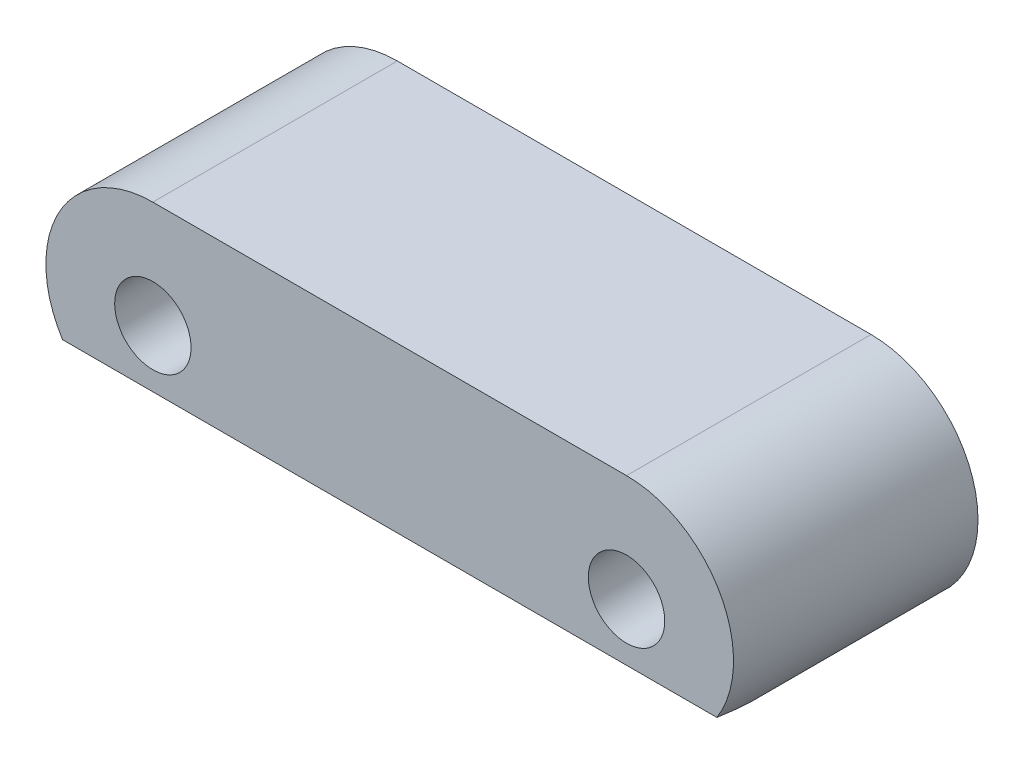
ISO-10303-21;
HEADER;
FILE_DESCRIPTION(('STEP AP214'),'2;1');
FILE_NAME('part.step','',(''),(''),'','','');
FILE_SCHEMA(('AUTOMOTIVE_DESIGN { 1 0 10303 214 1 1 1 1 }'));
ENDSEC;
DATA;
#1=APPLICATION_CONTEXT('core data for automotive mechanical design processes');
#2=APPLICATION_PROTOCOL_DEFINITION('international standard','automotive_design',2000,#1);
#3=PRODUCT_CONTEXT('',#1,'mechanical');
#4=PRODUCT('Part','Part','',(#3));
#5=PRODUCT_RELATED_PRODUCT_CATEGORY('part','',(#4));
#6=PRODUCT_DEFINITION_FORMATION('','',#4);
#7=PRODUCT_DEFINITION_CONTEXT('part definition',#1,'design');
#8=PRODUCT_DEFINITION('design','',#6,#7);
#9=PRODUCT_DEFINITION_SHAPE('','',#8);
#10=(LENGTH_UNIT() NAMED_UNIT(*) SI_UNIT(.MILLI.,.METRE.));
#11=(NAMED_UNIT(*) PLANE_ANGLE_UNIT() SI_UNIT($,.RADIAN.));
#12=(NAMED_UNIT(*) SI_UNIT($,.STERADIAN.) SOLID_ANGLE_UNIT());
#13=UNCERTAINTY_MEASURE_WITH_UNIT(LENGTH_MEASURE(1.E-05),#10,'distance_accuracy_value','');
#14=(GEOMETRIC_REPRESENTATION_CONTEXT(3) GLOBAL_UNCERTAINTY_ASSIGNED_CONTEXT((#13)) GLOBAL_UNIT_ASSIGNED_CONTEXT((#10,
#11,#12)) REPRESENTATION_CONTEXT('',''));
#15=CARTESIAN_POINT('',(0.,0.,0.));
#16=DIRECTION('',(0.,0.,1.));
#17=DIRECTION('',(1.,0.,0.));
#18=AXIS2_PLACEMENT_3D('',#15,#16,#17);
#19=CARTESIAN_POINT('',(0.,0.,16.));
#20=DIRECTION('',(0.,0.,1.));
#21=DIRECTION('',(1.,0.,0.));
#22=AXIS2_PLACEMENT_3D('',#19,#20,#21);
#23=PLANE('',#22);
#24=CARTESIAN_POINT('',(0.,0.,16.));
#25=DIRECTION('',(0.,0.,-1.));
#26=DIRECTION('',(-1.,0.,0.));
#27=AXIS2_PLACEMENT_3D('',#24,#25,#26);
#28=CIRCLE('',#27,2.5);
#29=CARTESIAN_POINT('',(-2.49999999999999,0.,16.));
#30=VERTEX_POINT('',#29);
#31=EDGE_CURVE('E156',#30,#30,#28,.T.);
#32=ORIENTED_EDGE('',*,*,#31,.T.);
#33=EDGE_LOOP('',(#32));
#34=FACE_BOUND('',#33,.T.);
#35=DIRECTION('',(-1.,0.,0.));
#36=VECTOR('',#35,1.);
#37=CARTESIAN_POINT('',(0.,-3.750803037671,16.));
#38=LINE('',#37,#36);
#39=CARTESIAN_POINT('',(36.9102856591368,-3.750803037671,16.));
#40=VERTEX_POINT('',#39);
#41=CARTESIAN_POINT('',(-5.91028565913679,-3.750803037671,16.));
#42=VERTEX_POINT('',#41);
#43=EDGE_CURVE('E11',#40,#42,#38,.T.);
#44=ORIENTED_EDGE('',*,*,#43,.F.);
#45=CARTESIAN_POINT('',(31.,0.,16.));
#46=DIRECTION('',(0.,0.,1.));
#47=DIRECTION('',(1.,0.,0.));
#48=AXIS2_PLACEMENT_3D('',#45,#46,#47);
#49=CIRCLE('',#48,7.);
#50=CARTESIAN_POINT('',(31.,6.99999999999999,16.));
#51=VERTEX_POINT('',#50);
#52=EDGE_CURVE('E86',#40,#51,#49,.T.);
#53=ORIENTED_EDGE('',*,*,#52,.T.);
#54=DIRECTION('',(-1.,0.,0.));
#55=VECTOR('',#54,1.);
#56=CARTESIAN_POINT('',(0.,6.99999999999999,16.));
#57=LINE('',#56,#55);
#58=CARTESIAN_POINT('',(0.,6.99999999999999,16.));
#59=VERTEX_POINT('',#58);
#60=EDGE_CURVE('E50',#51,#59,#57,.T.);
#61=ORIENTED_EDGE('',*,*,#60,.T.);
#62=CARTESIAN_POINT('',(0.,0.,16.));
#63=DIRECTION('',(0.,0.,1.));
#64=DIRECTION('',(1.,0.,0.));
#65=AXIS2_PLACEMENT_3D('',#62,#63,#64);
#66=CIRCLE('',#65,7.);
#67=EDGE_CURVE('E81',#59,#42,#66,.T.);
#68=ORIENTED_EDGE('',*,*,#67,.T.);
#69=EDGE_LOOP('',(#44,#53,#61,#68));
#70=FACE_BOUND('',#69,.T.);
#71=CARTESIAN_POINT('',(31.,0.,16.));
#72=DIRECTION('',(0.,0.,-1.));
#73=DIRECTION('',(-1.,0.,0.));
#74=AXIS2_PLACEMENT_3D('',#71,#72,#73);
#75=CIRCLE('',#74,2.5);
#76=CARTESIAN_POINT('',(28.5,0.,16.));
#77=VERTEX_POINT('',#76);
#78=EDGE_CURVE('E152',#77,#77,#75,.T.);
#79=ORIENTED_EDGE('',*,*,#78,.T.);
#80=EDGE_LOOP('',(#79));
#81=FACE_BOUND('',#80,.T.);
#82=ADVANCED_FACE('F28',(#34,#70,#81),#23,.T.);
#83=CARTESIAN_POINT('',(0.,0.,16.));
#84=DIRECTION('',(0.,0.,-1.));
#85=DIRECTION('',(-1.,0.,0.));
#86=AXIS2_PLACEMENT_3D('',#83,#84,#85);
#87=CYLINDRICAL_SURFACE('',#86,7.);
#88=DIRECTION('',(0.,0.,-1.));
#89=VECTOR('',#88,1.);
#90=CARTESIAN_POINT('',(0.,-7.00000000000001,16.));
#91=LINE('',#90,#89);
#92=CARTESIAN_POINT('',(0.,-7.,6.));
#93=VERTEX_POINT('',#92);
#94=CARTESIAN_POINT('',(0.,-7.,0.));
#95=VERTEX_POINT('',#94);
#96=EDGE_CURVE('E36',#93,#95,#91,.T.);
#97=ORIENTED_EDGE('',*,*,#96,.F.);
#98=CARTESIAN_POINT('',(0.,0.,27.5437847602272));
#99=DIRECTION('',(0.,0.951056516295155,-0.309016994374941));
#100=DIRECTION('',(0.,-0.309016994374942,-0.951056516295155));
#101=AXIS2_PLACEMENT_3D('',#98,#99,#100);
#102=ELLIPSE('',#101,22.652475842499,7.);
#103=EDGE_CURVE('E74',#93,#42,#102,.T.);
#104=ORIENTED_EDGE('',*,*,#103,.T.);
#105=ORIENTED_EDGE('',*,*,#67,.F.);
#106=DIRECTION('',(0.,0.,-1.));
#107=VECTOR('',#106,1.);
#108=CARTESIAN_POINT('',(0.,6.99999999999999,16.));
#109=LINE('',#108,#107);
#110=CARTESIAN_POINT('',(0.,7.00000000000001,0.));
#111=VERTEX_POINT('',#110);
#112=EDGE_CURVE('E95',#59,#111,#109,.T.);
#113=ORIENTED_EDGE('',*,*,#112,.T.);
#114=CARTESIAN_POINT('',(0.,0.,0.));
#115=DIRECTION('',(0.,0.,1.));
#116=DIRECTION('',(1.,0.,0.));
#117=AXIS2_PLACEMENT_3D('',#114,#115,#116);
#118=CIRCLE('',#117,7.);
#119=EDGE_CURVE('E83',#111,#95,#118,.T.);
#120=ORIENTED_EDGE('',*,*,#119,.T.);
#121=EDGE_LOOP('',(#97,#104,#105,#113,#120));
#122=FACE_BOUND('',#121,.T.);
#123=ADVANCED_FACE('F30',(#122),#87,.T.);
#124=CARTESIAN_POINT('',(0.,-7.00000000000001,16.));
#125=DIRECTION('',(0.,1.,0.));
#126=DIRECTION('',(0.,0.,1.));
#127=AXIS2_PLACEMENT_3D('',#124,#125,#126);
#128=PLANE('',#127);
#129=DIRECTION('',(0.,0.,-1.));
#130=VECTOR('',#129,1.);
#131=CARTESIAN_POINT('',(31.,-7.00000000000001,16.));
#132=LINE('',#131,#130);
#133=CARTESIAN_POINT('',(31.,-7.00000000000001,6.));
#134=VERTEX_POINT('',#133);
#135=CARTESIAN_POINT('',(31.,-7.,0.));
#136=VERTEX_POINT('',#135);
#137=EDGE_CURVE('E100',#134,#136,#132,.T.);
#138=ORIENTED_EDGE('',*,*,#137,.F.);
#139=DIRECTION('',(1.,0.,0.));
#140=VECTOR('',#139,1.);
#141=CARTESIAN_POINT('',(-7.,-7.,6.));
#142=LINE('',#141,#140);
#143=EDGE_CURVE('E108',#93,#134,#142,.T.);
#144=ORIENTED_EDGE('',*,*,#143,.F.);
#145=ORIENTED_EDGE('',*,*,#96,.T.);
#146=DIRECTION('',(1.,0.,0.));
#147=VECTOR('',#146,1.);
#148=CARTESIAN_POINT('',(0.,-7.,0.));
#149=LINE('',#148,#147);
#150=EDGE_CURVE('E106',#95,#136,#149,.T.);
#151=ORIENTED_EDGE('',*,*,#150,.T.);
#152=EDGE_LOOP('',(#138,#144,#145,#151));
#153=FACE_BOUND('',#152,.T.);
#154=ADVANCED_FACE('F105',(#153),#128,.F.);
#155=CARTESIAN_POINT('',(31.,0.,16.));
#156=DIRECTION('',(0.,0.,-1.));
#157=DIRECTION('',(-1.,0.,0.));
#158=AXIS2_PLACEMENT_3D('',#155,#156,#157);
#159=CYLINDRICAL_SURFACE('',#158,7.);
#160=ORIENTED_EDGE('',*,*,#52,.F.);
#161=CARTESIAN_POINT('',(31.,0.,27.5437847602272));
#162=DIRECTION('',(0.,0.951056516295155,-0.309016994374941));
#163=DIRECTION('',(0.,-0.309016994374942,-0.951056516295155));
#164=AXIS2_PLACEMENT_3D('',#161,#162,#163);
#165=ELLIPSE('',#164,22.652475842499,7.);
#166=EDGE_CURVE('E42',#40,#134,#165,.T.);
#167=ORIENTED_EDGE('',*,*,#166,.T.);
#168=ORIENTED_EDGE('',*,*,#137,.T.);
#169=CARTESIAN_POINT('',(31.,0.,0.));
#170=DIRECTION('',(0.,0.,1.));
#171=DIRECTION('',(1.,0.,0.));
#172=AXIS2_PLACEMENT_3D('',#169,#170,#171);
#173=CIRCLE('',#172,7.);
#174=CARTESIAN_POINT('',(31.,7.00000000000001,0.));
#175=VERTEX_POINT('',#174);
#176=EDGE_CURVE('E90',#136,#175,#173,.T.);
#177=ORIENTED_EDGE('',*,*,#176,.T.);
#178=DIRECTION('',(0.,0.,-1.));
#179=VECTOR('',#178,1.);
#180=CARTESIAN_POINT('',(31.,6.99999999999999,16.));
#181=LINE('',#180,#179);
#182=EDGE_CURVE('E97',#51,#175,#181,.T.);
#183=ORIENTED_EDGE('',*,*,#182,.F.);
#184=EDGE_LOOP('',(#160,#167,#168,#177,#183));
#185=FACE_BOUND('',#184,.T.);
#186=ADVANCED_FACE('F118',(#185),#159,.T.);
#187=CARTESIAN_POINT('',(0.,6.99999999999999,16.));
#188=DIRECTION('',(0.,-1.,0.));
#189=DIRECTION('',(0.,0.,-1.));
#190=AXIS2_PLACEMENT_3D('',#187,#188,#189);
#191=PLANE('',#190);
#192=DIRECTION('',(-1.,0.,0.));
#193=VECTOR('',#192,1.);
#194=CARTESIAN_POINT('',(0.,7.00000000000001,0.));
#195=LINE('',#194,#193);
#196=EDGE_CURVE('E87',#175,#111,#195,.T.);
#197=ORIENTED_EDGE('',*,*,#196,.T.);
#198=ORIENTED_EDGE('',*,*,#112,.F.);
#199=ORIENTED_EDGE('',*,*,#60,.F.);
#200=ORIENTED_EDGE('',*,*,#182,.T.);
#201=EDGE_LOOP('',(#197,#198,#199,#200));
#202=FACE_BOUND('',#201,.T.);
#203=ADVANCED_FACE('F120',(#202),#191,.F.);
#204=CARTESIAN_POINT('',(0.,0.,0.));
#205=DIRECTION('',(0.,0.,1.));
#206=DIRECTION('',(1.,0.,0.));
#207=AXIS2_PLACEMENT_3D('',#204,#205,#206);
#208=PLANE('',#207);
#209=CARTESIAN_POINT('',(31.,0.,0.));
#210=DIRECTION('',(0.,0.,-1.));
#211=DIRECTION('',(-1.,0.,0.));
#212=AXIS2_PLACEMENT_3D('',#209,#210,#211);
#213=CIRCLE('',#212,2.49999999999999);
#214=CARTESIAN_POINT('',(28.5,0.,0.));
#215=VERTEX_POINT('',#214);
#216=EDGE_CURVE('E155',#215,#215,#213,.T.);
#217=ORIENTED_EDGE('',*,*,#216,.F.);
#218=EDGE_LOOP('',(#217));
#219=FACE_BOUND('',#218,.T.);
#220=CARTESIAN_POINT('',(0.,0.,0.));
#221=DIRECTION('',(0.,0.,-1.));
#222=DIRECTION('',(-1.,0.,0.));
#223=AXIS2_PLACEMENT_3D('',#220,#221,#222);
#224=CIRCLE('',#223,2.49999999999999);
#225=CARTESIAN_POINT('',(-2.49999999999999,0.,0.));
#226=VERTEX_POINT('',#225);
#227=EDGE_CURVE('E158',#226,#226,#224,.T.);
#228=ORIENTED_EDGE('',*,*,#227,.F.);
#229=EDGE_LOOP('',(#228));
#230=FACE_BOUND('',#229,.T.);
#231=ORIENTED_EDGE('',*,*,#119,.F.);
#232=ORIENTED_EDGE('',*,*,#196,.F.);
#233=ORIENTED_EDGE('',*,*,#176,.F.);
#234=ORIENTED_EDGE('',*,*,#150,.F.);
#235=EDGE_LOOP('',(#231,#232,#233,#234));
#236=FACE_BOUND('',#235,.T.);
#237=ADVANCED_FACE('F111',(#219,#230,#236),#208,.F.);
#238=CARTESIAN_POINT('',(-7.,-7.,6.));
#239=DIRECTION('',(0.,0.951056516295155,-0.309016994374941));
#240=DIRECTION('',(0.,0.309016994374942,0.951056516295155));
#241=AXIS2_PLACEMENT_3D('',#238,#239,#240);
#242=PLANE('',#241);
#243=ORIENTED_EDGE('',*,*,#143,.T.);
#244=ORIENTED_EDGE('',*,*,#166,.F.);
#245=ORIENTED_EDGE('',*,*,#43,.T.);
#246=ORIENTED_EDGE('',*,*,#103,.F.);
#247=EDGE_LOOP('',(#243,#244,#245,#246));
#248=FACE_BOUND('',#247,.T.);
#249=ADVANCED_FACE('F73',(#248),#242,.F.);
#250=CARTESIAN_POINT('',(0.,0.,0.));
#251=DIRECTION('',(0.,0.,-1.));
#252=DIRECTION('',(-1.,0.,0.));
#253=AXIS2_PLACEMENT_3D('',#250,#251,#252);
#254=CYLINDRICAL_SURFACE('',#253,2.49999999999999);
#255=CARTESIAN_POINT('',(-2.49999999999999,0.,16.));
#256=CARTESIAN_POINT('',(-2.49999999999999,0.,15.8333333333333));
#257=CARTESIAN_POINT('',(-2.49999999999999,0.,15.6666666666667));
#258=CARTESIAN_POINT('',(-2.49999999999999,0.,15.3333333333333));
#259=CARTESIAN_POINT('',(-2.49999999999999,0.,15.1666666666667));
#260=CARTESIAN_POINT('',(-2.49999999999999,0.,14.8333333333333));
#261=CARTESIAN_POINT('',(-2.49999999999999,0.,14.6666666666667));
#262=CARTESIAN_POINT('',(-2.49999999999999,0.,14.3333333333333));
#263=CARTESIAN_POINT('',(-2.49999999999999,0.,14.1666666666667));
#264=CARTESIAN_POINT('',(-2.49999999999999,0.,13.8333333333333));
#265=CARTESIAN_POINT('',(-2.49999999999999,0.,13.6666666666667));
#266=CARTESIAN_POINT('',(-2.49999999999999,0.,13.3333333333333));
#267=CARTESIAN_POINT('',(-2.49999999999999,0.,13.1666666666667));
#268=CARTESIAN_POINT('',(-2.49999999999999,0.,12.8333333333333));
#269=CARTESIAN_POINT('',(-2.49999999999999,0.,12.6666666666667));
#270=CARTESIAN_POINT('',(-2.49999999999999,0.,12.3333333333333));
#271=CARTESIAN_POINT('',(-2.49999999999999,0.,12.1666666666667));
#272=CARTESIAN_POINT('',(-2.49999999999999,0.,11.8333333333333));
#273=CARTESIAN_POINT('',(-2.49999999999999,0.,11.6666666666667));
#274=CARTESIAN_POINT('',(-2.49999999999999,0.,11.3333333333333));
#275=CARTESIAN_POINT('',(-2.49999999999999,0.,11.1666666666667));
#276=CARTESIAN_POINT('',(-2.49999999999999,0.,10.8333333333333));
#277=CARTESIAN_POINT('',(-2.49999999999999,0.,10.6666666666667));
#278=CARTESIAN_POINT('',(-2.49999999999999,0.,10.3333333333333));
#279=CARTESIAN_POINT('',(-2.49999999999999,0.,10.1666666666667));
#280=CARTESIAN_POINT('',(-2.49999999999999,0.,9.83333333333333));
#281=CARTESIAN_POINT('',(-2.49999999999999,0.,9.66666666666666));
#282=CARTESIAN_POINT('',(-2.49999999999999,0.,9.33333333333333));
#283=CARTESIAN_POINT('',(-2.49999999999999,0.,9.16666666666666));
#284=CARTESIAN_POINT('',(-2.49999999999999,0.,8.83333333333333));
#285=CARTESIAN_POINT('',(-2.49999999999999,0.,8.66666666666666));
#286=CARTESIAN_POINT('',(-2.49999999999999,0.,8.33333333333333));
#287=CARTESIAN_POINT('',(-2.49999999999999,0.,8.16666666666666));
#288=CARTESIAN_POINT('',(-2.49999999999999,0.,7.83333333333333));
#289=CARTESIAN_POINT('',(-2.49999999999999,0.,7.66666666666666));
#290=CARTESIAN_POINT('',(-2.49999999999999,0.,7.33333333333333));
#291=CARTESIAN_POINT('',(-2.49999999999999,0.,7.16666666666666));
#292=CARTESIAN_POINT('',(-2.49999999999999,0.,6.83333333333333));
#293=CARTESIAN_POINT('',(-2.49999999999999,0.,6.66666666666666));
#294=CARTESIAN_POINT('',(-2.49999999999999,0.,6.33333333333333));
#295=CARTESIAN_POINT('',(-2.49999999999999,0.,6.16666666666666));
#296=CARTESIAN_POINT('',(-2.49999999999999,0.,5.83333333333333));
#297=CARTESIAN_POINT('',(-2.49999999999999,0.,5.66666666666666));
#298=CARTESIAN_POINT('',(-2.49999999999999,0.,5.33333333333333));
#299=CARTESIAN_POINT('',(-2.49999999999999,0.,5.16666666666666));
#300=CARTESIAN_POINT('',(-2.49999999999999,0.,4.83333333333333));
#301=CARTESIAN_POINT('',(-2.49999999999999,0.,4.66666666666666));
#302=CARTESIAN_POINT('',(-2.49999999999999,0.,4.33333333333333));
#303=CARTESIAN_POINT('',(-2.49999999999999,0.,4.16666666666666));
#304=CARTESIAN_POINT('',(-2.49999999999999,0.,3.83333333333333));
#305=CARTESIAN_POINT('',(-2.49999999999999,0.,3.66666666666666));
#306=CARTESIAN_POINT('',(-2.49999999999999,0.,3.33333333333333));
#307=CARTESIAN_POINT('',(-2.49999999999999,0.,3.16666666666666));
#308=CARTESIAN_POINT('',(-2.49999999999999,0.,2.83333333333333));
#309=CARTESIAN_POINT('',(-2.49999999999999,0.,2.66666666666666));
#310=CARTESIAN_POINT('',(-2.49999999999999,0.,2.33333333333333));
#311=CARTESIAN_POINT('',(-2.49999999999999,0.,2.16666666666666));
#312=CARTESIAN_POINT('',(-2.49999999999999,0.,1.83333333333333));
#313=CARTESIAN_POINT('',(-2.49999999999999,0.,1.66666666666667));
#314=CARTESIAN_POINT('',(-2.49999999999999,0.,1.33333333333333));
#315=CARTESIAN_POINT('',(-2.49999999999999,0.,1.16666666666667));
#316=CARTESIAN_POINT('',(-2.49999999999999,0.,0.833333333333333));
#317=CARTESIAN_POINT('',(-2.49999999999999,0.,0.666666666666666));
#318=CARTESIAN_POINT('',(-2.49999999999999,0.,0.333333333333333));
#319=CARTESIAN_POINT('',(-2.49999999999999,0.,0.166666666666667));
#320=CARTESIAN_POINT('',(-2.49999999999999,0.,0.));
#321=B_SPLINE_CURVE_WITH_KNOTS('',3,(#255,#256,#257,#258,#259,#260,#261,#262,#263,#264,#265,
#266,#267,#268,#269,#270,#271,#272,#273,#274,#275,#276,#277,#278,#279,#280,#281,#282,#283,#284,
#285,#286,#287,#288,#289,#290,#291,#292,#293,#294,#295,#296,#297,#298,#299,#300,#301,#302,#303,
#304,#305,#306,#307,#308,#309,#310,#311,#312,#313,#314,#315,#316,#317,#318,#319,#320),
.UNSPECIFIED.,.F.,.F.,(4,2,2,2,2,2,2,2,2,2,2,2,2,2,2,2,2,2,2,2,2,2,2,2,2,2,2,2,2,2,2,2,4),(0.,
0.499999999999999,0.999999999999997,1.5,2.,2.5,3.,3.5,3.99999999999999,4.49999999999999,
4.99999999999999,5.49999999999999,5.99999999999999,6.49999999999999,6.99999999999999,
7.49999999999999,7.99999999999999,8.49999999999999,8.99999999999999,9.49999999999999,
9.99999999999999,10.5,11.,11.5,12.,12.5,13.,13.5,14.,14.5,15.,15.5,16.),.UNSPECIFIED.);
#322=EDGE_CURVE('BSEAM140',#30,#226,#321,.T.);
#323=ORIENTED_EDGE('',*,*,#31,.F.);
#324=ORIENTED_EDGE('',*,*,#227,.T.);
#325=ORIENTED_EDGE('',*,*,#322,.T.);
#326=ORIENTED_EDGE('',*,*,#322,.F.);
#327=EDGE_LOOP('',(#323,#325,#324,#326));
#328=FACE_BOUND('',#327,.T.);
#329=ADVANCED_FACE('F140',(#328),#254,.F.);
#330=CARTESIAN_POINT('',(31.,0.,0.));
#331=DIRECTION('',(0.,0.,-1.));
#332=DIRECTION('',(-1.,0.,0.));
#333=AXIS2_PLACEMENT_3D('',#330,#331,#332);
#334=CYLINDRICAL_SURFACE('',#333,2.49999999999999);
#335=CARTESIAN_POINT('',(28.5,0.,16.));
#336=CARTESIAN_POINT('',(28.5,0.,15.8333333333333));
#337=CARTESIAN_POINT('',(28.5,0.,15.6666666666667));
#338=CARTESIAN_POINT('',(28.5,0.,15.3333333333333));
#339=CARTESIAN_POINT('',(28.5,0.,15.1666666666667));
#340=CARTESIAN_POINT('',(28.5,0.,14.8333333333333));
#341=CARTESIAN_POINT('',(28.5,0.,14.6666666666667));
#342=CARTESIAN_POINT('',(28.5,0.,14.3333333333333));
#343=CARTESIAN_POINT('',(28.5,0.,14.1666666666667));
#344=CARTESIAN_POINT('',(28.5,0.,13.8333333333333));
#345=CARTESIAN_POINT('',(28.5,0.,13.6666666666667));
#346=CARTESIAN_POINT('',(28.5,0.,13.3333333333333));
#347=CARTESIAN_POINT('',(28.5,0.,13.1666666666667));
#348=CARTESIAN_POINT('',(28.5,0.,12.8333333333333));
#349=CARTESIAN_POINT('',(28.5,0.,12.6666666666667));
#350=CARTESIAN_POINT('',(28.5,0.,12.3333333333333));
#351=CARTESIAN_POINT('',(28.5,0.,12.1666666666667));
#352=CARTESIAN_POINT('',(28.5,0.,11.8333333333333));
#353=CARTESIAN_POINT('',(28.5,0.,11.6666666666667));
#354=CARTESIAN_POINT('',(28.5,0.,11.3333333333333));
#355=CARTESIAN_POINT('',(28.5,0.,11.1666666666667));
#356=CARTESIAN_POINT('',(28.5,0.,10.8333333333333));
#357=CARTESIAN_POINT('',(28.5,0.,10.6666666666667));
#358=CARTESIAN_POINT('',(28.5,0.,10.3333333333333));
#359=CARTESIAN_POINT('',(28.5,0.,10.1666666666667));
#360=CARTESIAN_POINT('',(28.5,0.,9.83333333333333));
#361=CARTESIAN_POINT('',(28.5,0.,9.66666666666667));
#362=CARTESIAN_POINT('',(28.5,0.,9.33333333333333));
#363=CARTESIAN_POINT('',(28.5,0.,9.16666666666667));
#364=CARTESIAN_POINT('',(28.5,0.,8.83333333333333));
#365=CARTESIAN_POINT('',(28.5,0.,8.66666666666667));
#366=CARTESIAN_POINT('',(28.5,0.,8.33333333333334));
#367=CARTESIAN_POINT('',(28.5,0.,8.16666666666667));
#368=CARTESIAN_POINT('',(28.5,0.,7.83333333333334));
#369=CARTESIAN_POINT('',(28.5,0.,7.66666666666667));
#370=CARTESIAN_POINT('',(28.5,0.,7.33333333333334));
#371=CARTESIAN_POINT('',(28.5,0.,7.16666666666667));
#372=CARTESIAN_POINT('',(28.5,0.,6.83333333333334));
#373=CARTESIAN_POINT('',(28.5,0.,6.66666666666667));
#374=CARTESIAN_POINT('',(28.5,0.,6.33333333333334));
#375=CARTESIAN_POINT('',(28.5,0.,6.16666666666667));
#376=CARTESIAN_POINT('',(28.5,0.,5.83333333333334));
#377=CARTESIAN_POINT('',(28.5,0.,5.66666666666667));
#378=CARTESIAN_POINT('',(28.5,0.,5.33333333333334));
#379=CARTESIAN_POINT('',(28.5,0.,5.16666666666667));
#380=CARTESIAN_POINT('',(28.5,0.,4.83333333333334));
#381=CARTESIAN_POINT('',(28.5,0.,4.66666666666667));
#382=CARTESIAN_POINT('',(28.5,0.,4.33333333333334));
#383=CARTESIAN_POINT('',(28.5,0.,4.16666666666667));
#384=CARTESIAN_POINT('',(28.5,0.,3.83333333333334));
#385=CARTESIAN_POINT('',(28.5,0.,3.66666666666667));
#386=CARTESIAN_POINT('',(28.5,0.,3.33333333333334));
#387=CARTESIAN_POINT('',(28.5,0.,3.16666666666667));
#388=CARTESIAN_POINT('',(28.5,0.,2.83333333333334));
#389=CARTESIAN_POINT('',(28.5,0.,2.66666666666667));
#390=CARTESIAN_POINT('',(28.5,0.,2.33333333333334));
#391=CARTESIAN_POINT('',(28.5,0.,2.16666666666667));
#392=CARTESIAN_POINT('',(28.5,0.,1.83333333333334));
#393=CARTESIAN_POINT('',(28.5,0.,1.66666666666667));
#394=CARTESIAN_POINT('',(28.5,0.,1.33333333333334));
#395=CARTESIAN_POINT('',(28.5,0.,1.16666666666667));
#396=CARTESIAN_POINT('',(28.5,0.,0.83333333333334));
#397=CARTESIAN_POINT('',(28.5,0.,0.666666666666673));
#398=CARTESIAN_POINT('',(28.5,0.,0.33333333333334));
#399=CARTESIAN_POINT('',(28.5,0.,0.166666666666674));
#400=CARTESIAN_POINT('',(28.5,0.,0.));
#401=B_SPLINE_CURVE_WITH_KNOTS('',3,(#335,#336,#337,#338,#339,#340,#341,#342,#343,#344,#345,
#346,#347,#348,#349,#350,#351,#352,#353,#354,#355,#356,#357,#358,#359,#360,#361,#362,#363,#364,
#365,#366,#367,#368,#369,#370,#371,#372,#373,#374,#375,#376,#377,#378,#379,#380,#381,#382,#383,
#384,#385,#386,#387,#388,#389,#390,#391,#392,#393,#394,#395,#396,#397,#398,#399,#400),
.UNSPECIFIED.,.F.,.F.,(4,2,2,2,2,2,2,2,2,2,2,2,2,2,2,2,2,2,2,2,2,2,2,2,2,2,2,2,2,2,2,2,4),(0.,
0.499999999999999,0.999999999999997,1.5,2.,2.5,3.,3.5,4.,4.5,5.,5.49999999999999,
5.99999999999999,6.5,7.,7.5,7.99999999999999,8.49999999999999,8.99999999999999,9.49999999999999,
9.99999999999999,10.5,11.,11.5,12.,12.5,13.,13.5,14.,14.5,15.,15.5,16.),.UNSPECIFIED.);
#402=EDGE_CURVE('BSEAM143',#77,#215,#401,.T.);
#403=ORIENTED_EDGE('',*,*,#78,.F.);
#404=ORIENTED_EDGE('',*,*,#216,.T.);
#405=ORIENTED_EDGE('',*,*,#402,.T.);
#406=ORIENTED_EDGE('',*,*,#402,.F.);
#407=EDGE_LOOP('',(#403,#405,#404,#406));
#408=FACE_BOUND('',#407,.T.);
#409=ADVANCED_FACE('F143',(#408),#334,.F.);
#410=CLOSED_SHELL('',(#82,#123,#154,#186,#203,#237,#249,#329,#409));
#411=MANIFOLD_SOLID_BREP('B2',#410);
#412=ADVANCED_BREP_SHAPE_REPRESENTATION('',(#18,#411),#14);
#413=SHAPE_DEFINITION_REPRESENTATION(#9,#412);
ENDSEC;
END-ISO-10303-21;
